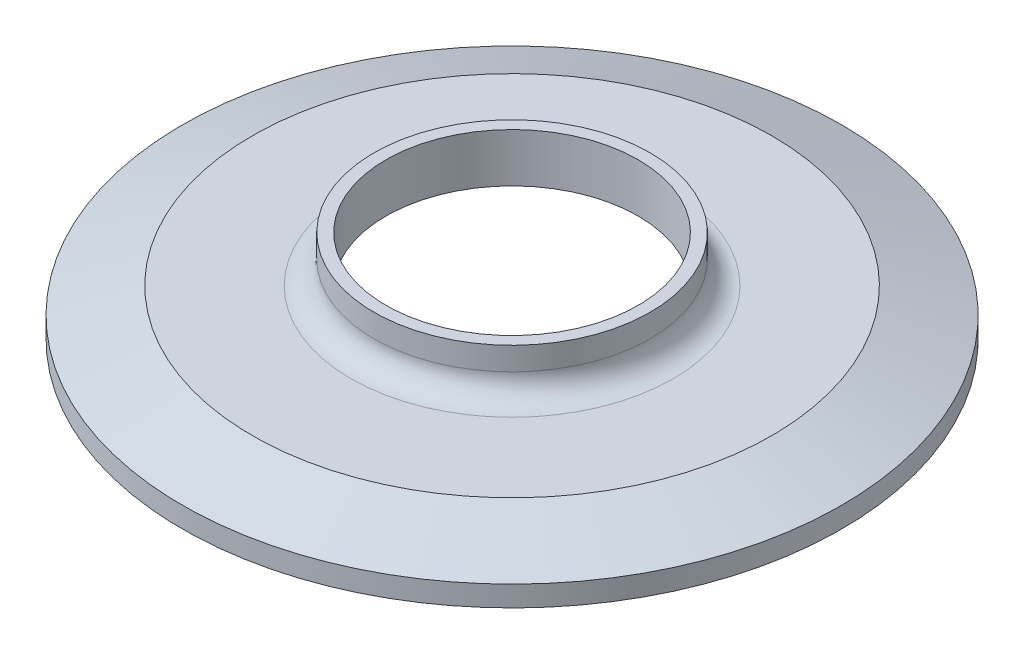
from build123d import *


with BuildPart() as part:
    # Sketch1 → Revolve1 (revolve)
    with BuildSketch(Plane.XY, mode=Mode.PRIVATE) as revolve1_sk:
        with BuildLine():
            Line((-19.05, 12.7), (-19.05, 9.525))
            ThreePointArc((-19.05, 9.525), (-19.97993597, 7.27993597), (-22.225, 6.35))
            Line((-22.225, 6.35), (-35.822842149, 6.35))
            Line((-35.822842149, 6.35), (-45.4533, 2.8448))
            Line((-45.4533, 2.8448), (-45.4533, 0))
            Line((-45.4533, 0), (-43.659272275, 0.002512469))
            ThreePointArc((-43.659272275, 0.002512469), (-43.224677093, 0.133310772), (-42.934466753, 0.482250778))
            Line((-42.934466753, 0.482250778), (-42.767598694, 0.87536729))
            ThreePointArc((-42.767598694, 0.87536729), (-41.6687, 1.602712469), (-40.569801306, 0.87536729))
            Line((-40.569801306, 0.87536729), (-40.402933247, 0.482250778))
            ThreePointArc((-40.402933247, 0.482250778), (-40.112722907, 0.133310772), (-39.678127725, 0.002512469))
            Line((-39.678127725, 0.002512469), (-36.449, 0))
            Line((-36.449, 0), (-17.399, 5.969908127))
            Line((-17.399, 5.969908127), (-17.399, 12.7))
            Line((-17.399, 12.7), (-19.05, 12.7))
        make_face()
    revolve(revolve1_sk.sketch.rotate(Axis((0, 0, 0), (0, 1, 0)), 270), axis=Axis((0, 0, 0), (0, 1, 0)))


solid = part.part
